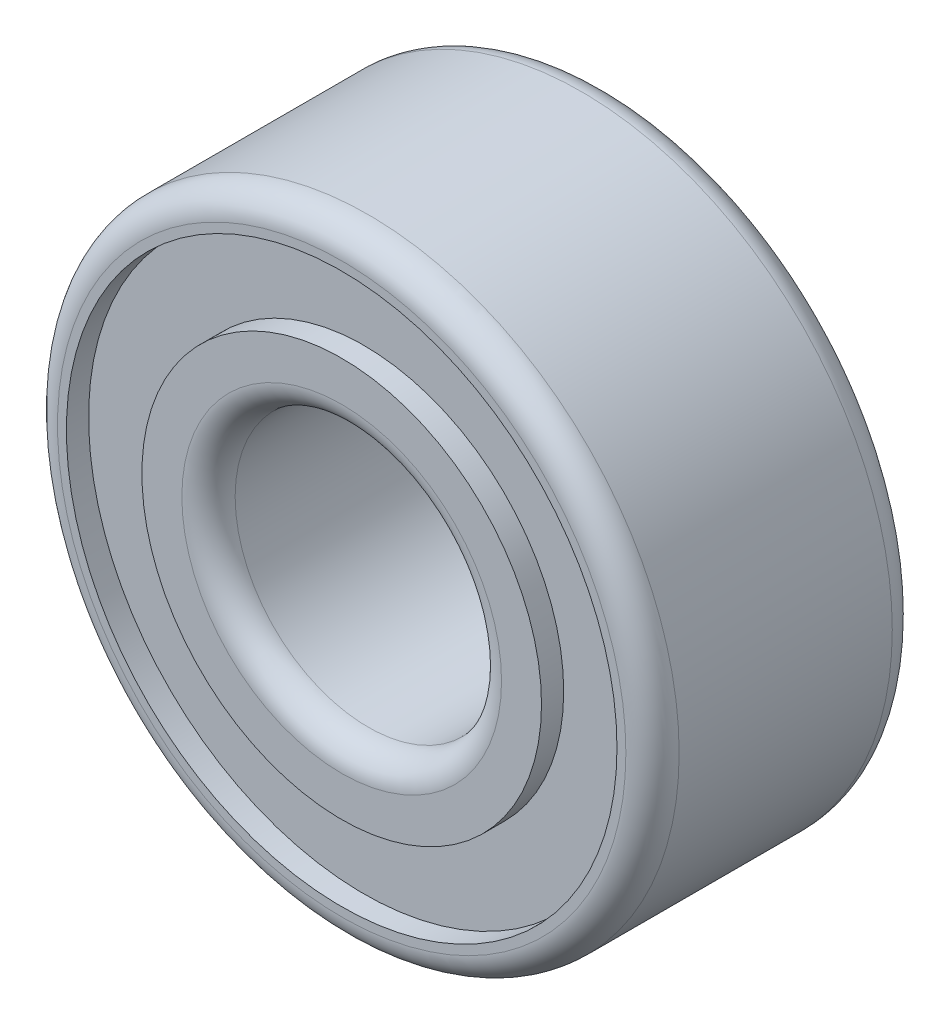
from build123d import *

# Parameters (mm, degrees)
ESQUISSE1_R             = 3.5
ESQUISSE1_R_2           = 1.5
BASE_EXTRUSION_DEPTH    = 1.5
CONG_1_R                = 0.3
ESQUISSE2_R             = 3.1
ESQUISSE2_R_2           = 2.25
ENL_V_MAT_EXTRU_1_DEPTH = 0.25


with BuildPart() as part:
    # Esquisse1 → Base-Extrusion (new, symmetric)
    with BuildSketch(Plane.XY):
        Circle(ESQUISSE1_R)
        Circle(ESQUISSE1_R_2, mode=Mode.SUBTRACT)
    extrude(amount=BASE_EXTRUSION_DEPTH, both=True)

    # Cong_1
    cong_1_edges = [part.edges().sort_by_distance(p)[0] for p in [
        (-3.5, 0, -1.5),
        (-3.5, 0, 1.5),
        (-1.5, 0, 1.5),
        (-1.5, 0, -1.5),
    ]]
    fillet(cong_1_edges, radius=CONG_1_R)

    # Esquisse2 → Enl_v. mat.-Extru.1 (cut)
    with BuildSketch(Plane.XY.offset(1.5)):
        Circle(ESQUISSE2_R)
        Circle(ESQUISSE2_R_2, mode=Mode.SUBTRACT)
    enl_v_mat_extru_1 = extrude(amount=-ENL_V_MAT_EXTRU_1_DEPTH, mode=Mode.SUBTRACT)

    # Sym_trie1: Enl_v. mat.-Extru.1 across plane
    add(enl_v_mat_extru_1.mirror(Plane.XY), mode=Mode.SUBTRACT)


solid = part.part
